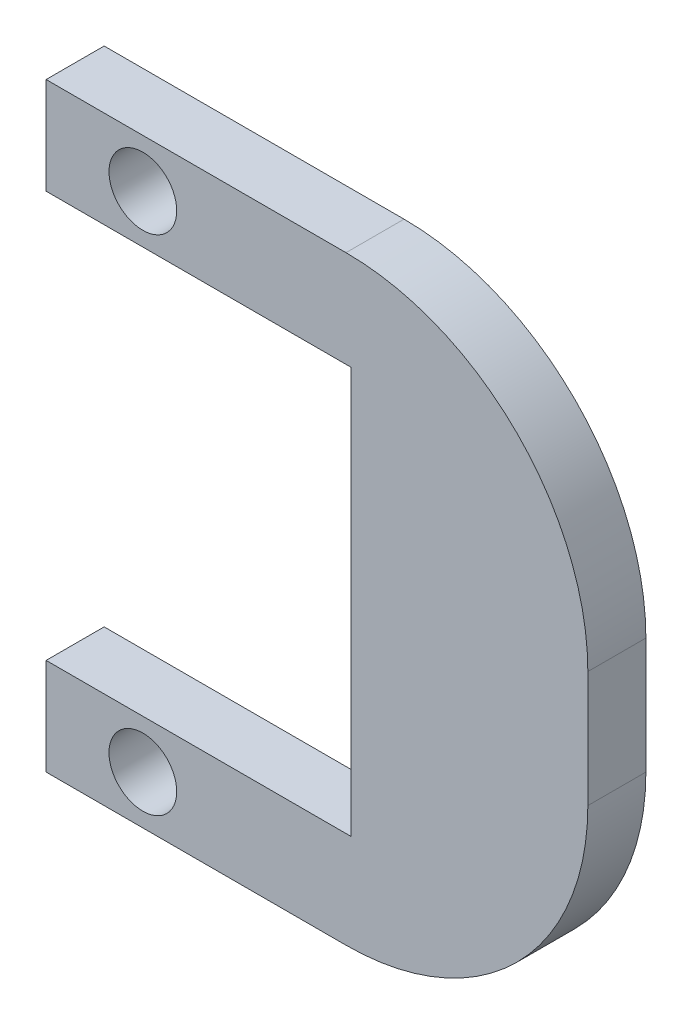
ISO-10303-21;
HEADER;
FILE_DESCRIPTION(('STEP AP214'),'2;1');
FILE_NAME('part.step','',(''),(''),'','','');
FILE_SCHEMA(('AUTOMOTIVE_DESIGN { 1 0 10303 214 1 1 1 1 }'));
ENDSEC;
DATA;
#1=APPLICATION_CONTEXT('core data for automotive mechanical design processes');
#2=APPLICATION_PROTOCOL_DEFINITION('international standard','automotive_design',2000,#1);
#3=PRODUCT_CONTEXT('',#1,'mechanical');
#4=PRODUCT('Part','Part','',(#3));
#5=PRODUCT_RELATED_PRODUCT_CATEGORY('part','',(#4));
#6=PRODUCT_DEFINITION_FORMATION('','',#4);
#7=PRODUCT_DEFINITION_CONTEXT('part definition',#1,'design');
#8=PRODUCT_DEFINITION('design','',#6,#7);
#9=PRODUCT_DEFINITION_SHAPE('','',#8);
#10=(LENGTH_UNIT() NAMED_UNIT(*) SI_UNIT(.MILLI.,.METRE.));
#11=(NAMED_UNIT(*) PLANE_ANGLE_UNIT() SI_UNIT($,.RADIAN.));
#12=(NAMED_UNIT(*) SI_UNIT($,.STERADIAN.) SOLID_ANGLE_UNIT());
#13=UNCERTAINTY_MEASURE_WITH_UNIT(LENGTH_MEASURE(1.E-05),#10,'distance_accuracy_value','');
#14=(GEOMETRIC_REPRESENTATION_CONTEXT(3) GLOBAL_UNCERTAINTY_ASSIGNED_CONTEXT((#13)) GLOBAL_UNIT_ASSIGNED_CONTEXT((#10,
#11,#12)) REPRESENTATION_CONTEXT('',''));
#15=CARTESIAN_POINT('',(0.,0.,0.));
#16=DIRECTION('',(0.,0.,1.));
#17=DIRECTION('',(1.,0.,0.));
#18=AXIS2_PLACEMENT_3D('',#15,#16,#17);
#19=CARTESIAN_POINT('',(3.,-5.99999999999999,6.));
#20=DIRECTION('',(0.,0.,1.));
#21=DIRECTION('',(1.,0.,0.));
#22=AXIS2_PLACEMENT_3D('',#19,#20,#21);
#23=PLANE('',#22);
#24=CARTESIAN_POINT('',(-18.,26.,6.));
#25=DIRECTION('',(0.,0.,1.));
#26=DIRECTION('',(1.,0.,0.));
#27=AXIS2_PLACEMENT_3D('',#24,#25,#26);
#28=CIRCLE('',#27,3.5);
#29=CARTESIAN_POINT('',(-14.5,26.,6.));
#30=VERTEX_POINT('',#29);
#31=EDGE_CURVE('E145',#30,#30,#28,.T.);
#32=ORIENTED_EDGE('',*,*,#31,.F.);
#33=EDGE_LOOP('',(#32));
#34=FACE_BOUND('',#33,.T.);
#35=DIRECTION('',(0.,-1.,0.));
#36=VECTOR('',#35,1.);
#37=CARTESIAN_POINT('',(-28.,31.,6.));
#38=LINE('',#37,#36);
#39=CARTESIAN_POINT('',(-28.,31.,6.));
#40=VERTEX_POINT('',#39);
#41=CARTESIAN_POINT('',(-28.,21.,6.));
#42=VERTEX_POINT('',#41);
#43=EDGE_CURVE('E160',#40,#42,#38,.T.);
#44=ORIENTED_EDGE('',*,*,#43,.T.);
#45=DIRECTION('',(1.,0.,0.));
#46=VECTOR('',#45,1.);
#47=CARTESIAN_POINT('',(-28.,21.,6.));
#48=LINE('',#47,#46);
#49=CARTESIAN_POINT('',(3.5,21.,6.));
#50=VERTEX_POINT('',#49);
#51=EDGE_CURVE('E98',#42,#50,#48,.T.);
#52=ORIENTED_EDGE('',*,*,#51,.T.);
#53=DIRECTION('',(0.,-1.,0.));
#54=VECTOR('',#53,1.);
#55=CARTESIAN_POINT('',(3.5,21.,6.));
#56=LINE('',#55,#54);
#57=CARTESIAN_POINT('',(3.49999999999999,-21.,6.));
#58=VERTEX_POINT('',#57);
#59=EDGE_CURVE('E181',#50,#58,#56,.T.);
#60=ORIENTED_EDGE('',*,*,#59,.T.);
#61=DIRECTION('',(-1.,0.,0.));
#62=VECTOR('',#61,1.);
#63=CARTESIAN_POINT('',(-28.,-21.,6.));
#64=LINE('',#63,#62);
#65=CARTESIAN_POINT('',(-28.,-21.,6.));
#66=VERTEX_POINT('',#65);
#67=EDGE_CURVE('E200',#58,#66,#64,.T.);
#68=ORIENTED_EDGE('',*,*,#67,.T.);
#69=DIRECTION('',(0.,-1.,0.));
#70=VECTOR('',#69,1.);
#71=CARTESIAN_POINT('',(-28.,-21.,6.));
#72=LINE('',#71,#70);
#73=CARTESIAN_POINT('',(-28.,-31.,6.));
#74=VERTEX_POINT('',#73);
#75=EDGE_CURVE('E197',#66,#74,#72,.T.);
#76=ORIENTED_EDGE('',*,*,#75,.T.);
#77=DIRECTION('',(1.,0.,0.));
#78=VECTOR('',#77,1.);
#79=CARTESIAN_POINT('',(-28.,-31.,6.));
#80=LINE('',#79,#78);
#81=CARTESIAN_POINT('',(2.99999999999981,-31.,6.));
#82=VERTEX_POINT('',#81);
#83=EDGE_CURVE('E199',#74,#82,#80,.T.);
#84=ORIENTED_EDGE('',*,*,#83,.T.);
#85=CARTESIAN_POINT('',(3.,-5.99999999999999,6.));
#86=DIRECTION('',(0.,0.,1.));
#87=DIRECTION('',(1.,0.,0.));
#88=AXIS2_PLACEMENT_3D('',#85,#86,#87);
#89=CIRCLE('',#88,25.);
#90=CARTESIAN_POINT('',(28.,-5.99999999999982,6.));
#91=VERTEX_POINT('',#90);
#92=EDGE_CURVE('E123',#82,#91,#89,.T.);
#93=ORIENTED_EDGE('',*,*,#92,.T.);
#94=DIRECTION('',(0.,1.,0.));
#95=VECTOR('',#94,1.);
#96=CARTESIAN_POINT('',(28.,5.99999999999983,6.));
#97=LINE('',#96,#95);
#98=CARTESIAN_POINT('',(28.,5.99999999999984,6.));
#99=VERTEX_POINT('',#98);
#100=EDGE_CURVE('E117',#91,#99,#97,.T.);
#101=ORIENTED_EDGE('',*,*,#100,.T.);
#102=CARTESIAN_POINT('',(3.,6.,6.));
#103=DIRECTION('',(0.,0.,1.));
#104=DIRECTION('',(-1.,0.,0.));
#105=AXIS2_PLACEMENT_3D('',#102,#103,#104);
#106=CIRCLE('',#105,25.);
#107=CARTESIAN_POINT('',(2.99999999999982,31.,6.));
#108=VERTEX_POINT('',#107);
#109=EDGE_CURVE('E121',#99,#108,#106,.T.);
#110=ORIENTED_EDGE('',*,*,#109,.T.);
#111=DIRECTION('',(-1.,0.,0.));
#112=VECTOR('',#111,1.);
#113=CARTESIAN_POINT('',(-28.,31.,6.));
#114=LINE('',#113,#112);
#115=EDGE_CURVE('E49',#108,#40,#114,.T.);
#116=ORIENTED_EDGE('',*,*,#115,.T.);
#117=EDGE_LOOP('',(#44,#52,#60,#68,#76,#84,#93,#101,#110,#116));
#118=FACE_BOUND('',#117,.T.);
#119=CARTESIAN_POINT('',(-18.,-26.,6.));
#120=DIRECTION('',(0.,0.,1.));
#121=DIRECTION('',(-1.,0.,0.));
#122=AXIS2_PLACEMENT_3D('',#119,#120,#121);
#123=CIRCLE('',#122,3.5);
#124=CARTESIAN_POINT('',(-21.5,-26.,6.));
#125=VERTEX_POINT('',#124);
#126=EDGE_CURVE('E211',#125,#125,#123,.T.);
#127=ORIENTED_EDGE('',*,*,#126,.F.);
#128=EDGE_LOOP('',(#127));
#129=FACE_BOUND('',#128,.T.);
#130=ADVANCED_FACE('F32',(#34,#118,#129),#23,.T.);
#131=CARTESIAN_POINT('',(3.,-5.99999999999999,0.));
#132=DIRECTION('',(0.,0.,1.));
#133=DIRECTION('',(1.,0.,0.));
#134=AXIS2_PLACEMENT_3D('',#131,#132,#133);
#135=PLANE('',#134);
#136=DIRECTION('',(0.,-1.,0.));
#137=VECTOR('',#136,1.);
#138=CARTESIAN_POINT('',(-28.,31.,0.));
#139=LINE('',#138,#137);
#140=CARTESIAN_POINT('',(-28.,31.,0.));
#141=VERTEX_POINT('',#140);
#142=CARTESIAN_POINT('',(-28.,21.,0.));
#143=VERTEX_POINT('',#142);
#144=EDGE_CURVE('E141',#141,#143,#139,.T.);
#145=ORIENTED_EDGE('',*,*,#144,.F.);
#146=DIRECTION('',(-1.,0.,0.));
#147=VECTOR('',#146,1.);
#148=CARTESIAN_POINT('',(-28.,31.,0.));
#149=LINE('',#148,#147);
#150=CARTESIAN_POINT('',(2.99999999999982,31.,0.));
#151=VERTEX_POINT('',#150);
#152=EDGE_CURVE('E90',#151,#141,#149,.T.);
#153=ORIENTED_EDGE('',*,*,#152,.F.);
#154=CARTESIAN_POINT('',(3.,6.,0.));
#155=DIRECTION('',(0.,0.,1.));
#156=DIRECTION('',(-1.,0.,0.));
#157=AXIS2_PLACEMENT_3D('',#154,#155,#156);
#158=CIRCLE('',#157,25.);
#159=CARTESIAN_POINT('',(28.,5.99999999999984,0.));
#160=VERTEX_POINT('',#159);
#161=EDGE_CURVE('E84',#160,#151,#158,.T.);
#162=ORIENTED_EDGE('',*,*,#161,.F.);
#163=DIRECTION('',(0.,1.,0.));
#164=VECTOR('',#163,1.);
#165=CARTESIAN_POINT('',(28.,5.99999999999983,0.));
#166=LINE('',#165,#164);
#167=CARTESIAN_POINT('',(28.,-5.99999999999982,0.));
#168=VERTEX_POINT('',#167);
#169=EDGE_CURVE('E131',#168,#160,#166,.T.);
#170=ORIENTED_EDGE('',*,*,#169,.F.);
#171=CARTESIAN_POINT('',(3.,-5.99999999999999,0.));
#172=DIRECTION('',(0.,0.,1.));
#173=DIRECTION('',(1.,0.,0.));
#174=AXIS2_PLACEMENT_3D('',#171,#172,#173);
#175=CIRCLE('',#174,25.);
#176=CARTESIAN_POINT('',(2.99999999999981,-31.,0.));
#177=VERTEX_POINT('',#176);
#178=EDGE_CURVE('E155',#177,#168,#175,.T.);
#179=ORIENTED_EDGE('',*,*,#178,.F.);
#180=DIRECTION('',(1.,0.,0.));
#181=VECTOR('',#180,1.);
#182=CARTESIAN_POINT('',(-28.,-31.,0.));
#183=LINE('',#182,#181);
#184=CARTESIAN_POINT('',(-28.,-31.,0.));
#185=VERTEX_POINT('',#184);
#186=EDGE_CURVE('E153',#185,#177,#183,.T.);
#187=ORIENTED_EDGE('',*,*,#186,.F.);
#188=DIRECTION('',(0.,-1.,0.));
#189=VECTOR('',#188,1.);
#190=CARTESIAN_POINT('',(-28.,-21.,0.));
#191=LINE('',#190,#189);
#192=CARTESIAN_POINT('',(-28.,-21.,0.));
#193=VERTEX_POINT('',#192);
#194=EDGE_CURVE('E151',#193,#185,#191,.T.);
#195=ORIENTED_EDGE('',*,*,#194,.F.);
#196=DIRECTION('',(-1.,0.,0.));
#197=VECTOR('',#196,1.);
#198=CARTESIAN_POINT('',(-28.,-21.,0.));
#199=LINE('',#198,#197);
#200=CARTESIAN_POINT('',(3.49999999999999,-21.,0.));
#201=VERTEX_POINT('',#200);
#202=EDGE_CURVE('E149',#201,#193,#199,.T.);
#203=ORIENTED_EDGE('',*,*,#202,.F.);
#204=DIRECTION('',(0.,-1.,0.));
#205=VECTOR('',#204,1.);
#206=CARTESIAN_POINT('',(3.5,21.,0.));
#207=LINE('',#206,#205);
#208=CARTESIAN_POINT('',(3.5,21.,0.));
#209=VERTEX_POINT('',#208);
#210=EDGE_CURVE('E147',#209,#201,#207,.T.);
#211=ORIENTED_EDGE('',*,*,#210,.F.);
#212=DIRECTION('',(1.,0.,0.));
#213=VECTOR('',#212,1.);
#214=CARTESIAN_POINT('',(-28.,21.,0.));
#215=LINE('',#214,#213);
#216=EDGE_CURVE('E144',#143,#209,#215,.T.);
#217=ORIENTED_EDGE('',*,*,#216,.F.);
#218=EDGE_LOOP('',(#145,#153,#162,#170,#179,#187,#195,#203,#211,#217));
#219=FACE_BOUND('',#218,.T.);
#220=CARTESIAN_POINT('',(-18.,26.,0.));
#221=DIRECTION('',(0.,0.,1.));
#222=DIRECTION('',(1.,0.,0.));
#223=AXIS2_PLACEMENT_3D('',#220,#221,#222);
#224=CIRCLE('',#223,3.5);
#225=CARTESIAN_POINT('',(-14.5,26.,0.));
#226=VERTEX_POINT('',#225);
#227=EDGE_CURVE('E208',#226,#226,#224,.T.);
#228=ORIENTED_EDGE('',*,*,#227,.T.);
#229=EDGE_LOOP('',(#228));
#230=FACE_BOUND('',#229,.T.);
#231=CARTESIAN_POINT('',(-18.,-26.,0.));
#232=DIRECTION('',(0.,0.,1.));
#233=DIRECTION('',(-1.,0.,0.));
#234=AXIS2_PLACEMENT_3D('',#231,#232,#233);
#235=CIRCLE('',#234,3.5);
#236=CARTESIAN_POINT('',(-21.5,-26.,0.));
#237=VERTEX_POINT('',#236);
#238=EDGE_CURVE('E214',#237,#237,#235,.T.);
#239=ORIENTED_EDGE('',*,*,#238,.T.);
#240=EDGE_LOOP('',(#239));
#241=FACE_BOUND('',#240,.T.);
#242=ADVANCED_FACE('F185',(#219,#230,#241),#135,.F.);
#243=CARTESIAN_POINT('',(-28.,31.,6.));
#244=DIRECTION('',(1.,0.,0.));
#245=DIRECTION('',(0.,1.,0.));
#246=AXIS2_PLACEMENT_3D('',#243,#244,#245);
#247=PLANE('',#246);
#248=ORIENTED_EDGE('',*,*,#144,.T.);
#249=DIRECTION('',(0.,0.,-1.));
#250=VECTOR('',#249,1.);
#251=CARTESIAN_POINT('',(-28.,21.,6.));
#252=LINE('',#251,#250);
#253=EDGE_CURVE('E11',#42,#143,#252,.T.);
#254=ORIENTED_EDGE('',*,*,#253,.F.);
#255=ORIENTED_EDGE('',*,*,#43,.F.);
#256=DIRECTION('',(0.,0.,-1.));
#257=VECTOR('',#256,1.);
#258=CARTESIAN_POINT('',(-28.,31.,6.));
#259=LINE('',#258,#257);
#260=EDGE_CURVE('E137',#40,#141,#259,.T.);
#261=ORIENTED_EDGE('',*,*,#260,.T.);
#262=EDGE_LOOP('',(#248,#254,#255,#261));
#263=FACE_BOUND('',#262,.T.);
#264=ADVANCED_FACE('F34',(#263),#247,.F.);
#265=CARTESIAN_POINT('',(-28.,21.,6.));
#266=DIRECTION('',(0.,1.,0.));
#267=DIRECTION('',(-1.,0.,0.));
#268=AXIS2_PLACEMENT_3D('',#265,#266,#267);
#269=PLANE('',#268);
#270=ORIENTED_EDGE('',*,*,#216,.T.);
#271=DIRECTION('',(0.,0.,-1.));
#272=VECTOR('',#271,1.);
#273=CARTESIAN_POINT('',(3.5,21.,6.));
#274=LINE('',#273,#272);
#275=EDGE_CURVE('E41',#50,#209,#274,.T.);
#276=ORIENTED_EDGE('',*,*,#275,.F.);
#277=ORIENTED_EDGE('',*,*,#51,.F.);
#278=ORIENTED_EDGE('',*,*,#253,.T.);
#279=EDGE_LOOP('',(#270,#276,#277,#278));
#280=FACE_BOUND('',#279,.T.);
#281=ADVANCED_FACE('F254',(#280),#269,.F.);
#282=CARTESIAN_POINT('',(3.5,21.,6.));
#283=DIRECTION('',(1.,0.,0.));
#284=DIRECTION('',(0.,1.,0.));
#285=AXIS2_PLACEMENT_3D('',#282,#283,#284);
#286=PLANE('',#285);
#287=ORIENTED_EDGE('',*,*,#210,.T.);
#288=DIRECTION('',(0.,0.,-1.));
#289=VECTOR('',#288,1.);
#290=CARTESIAN_POINT('',(3.49999999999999,-21.,6.));
#291=LINE('',#290,#289);
#292=EDGE_CURVE('E173',#58,#201,#291,.T.);
#293=ORIENTED_EDGE('',*,*,#292,.F.);
#294=ORIENTED_EDGE('',*,*,#59,.F.);
#295=ORIENTED_EDGE('',*,*,#275,.T.);
#296=EDGE_LOOP('',(#287,#293,#294,#295));
#297=FACE_BOUND('',#296,.T.);
#298=ADVANCED_FACE('F179',(#297),#286,.F.);
#299=CARTESIAN_POINT('',(-28.,-21.,6.));
#300=DIRECTION('',(0.,-1.,0.));
#301=DIRECTION('',(1.,0.,0.));
#302=AXIS2_PLACEMENT_3D('',#299,#300,#301);
#303=PLANE('',#302);
#304=ORIENTED_EDGE('',*,*,#202,.T.);
#305=DIRECTION('',(0.,0.,-1.));
#306=VECTOR('',#305,1.);
#307=CARTESIAN_POINT('',(-28.,-21.,6.));
#308=LINE('',#307,#306);
#309=EDGE_CURVE('E170',#66,#193,#308,.T.);
#310=ORIENTED_EDGE('',*,*,#309,.F.);
#311=ORIENTED_EDGE('',*,*,#67,.F.);
#312=ORIENTED_EDGE('',*,*,#292,.T.);
#313=EDGE_LOOP('',(#304,#310,#311,#312));
#314=FACE_BOUND('',#313,.T.);
#315=ADVANCED_FACE('F191',(#314),#303,.F.);
#316=CARTESIAN_POINT('',(-28.,-21.,6.));
#317=DIRECTION('',(1.,0.,0.));
#318=DIRECTION('',(0.,1.,0.));
#319=AXIS2_PLACEMENT_3D('',#316,#317,#318);
#320=PLANE('',#319);
#321=ORIENTED_EDGE('',*,*,#194,.T.);
#322=DIRECTION('',(0.,0.,-1.));
#323=VECTOR('',#322,1.);
#324=CARTESIAN_POINT('',(-28.,-31.,6.));
#325=LINE('',#324,#323);
#326=EDGE_CURVE('E167',#74,#185,#325,.T.);
#327=ORIENTED_EDGE('',*,*,#326,.F.);
#328=ORIENTED_EDGE('',*,*,#75,.F.);
#329=ORIENTED_EDGE('',*,*,#309,.T.);
#330=EDGE_LOOP('',(#321,#327,#328,#329));
#331=FACE_BOUND('',#330,.T.);
#332=ADVANCED_FACE('F195',(#331),#320,.F.);
#333=CARTESIAN_POINT('',(-28.,-31.,6.));
#334=DIRECTION('',(0.,1.,0.));
#335=DIRECTION('',(0.,0.,1.));
#336=AXIS2_PLACEMENT_3D('',#333,#334,#335);
#337=PLANE('',#336);
#338=ORIENTED_EDGE('',*,*,#186,.T.);
#339=DIRECTION('',(0.,0.,-1.));
#340=VECTOR('',#339,1.);
#341=CARTESIAN_POINT('',(2.99999999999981,-31.,6.));
#342=LINE('',#341,#340);
#343=EDGE_CURVE('E164',#82,#177,#342,.T.);
#344=ORIENTED_EDGE('',*,*,#343,.F.);
#345=ORIENTED_EDGE('',*,*,#83,.F.);
#346=ORIENTED_EDGE('',*,*,#326,.T.);
#347=EDGE_LOOP('',(#338,#344,#345,#346));
#348=FACE_BOUND('',#347,.T.);
#349=ADVANCED_FACE('F244',(#348),#337,.F.);
#350=CARTESIAN_POINT('',(3.,-5.99999999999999,6.));
#351=DIRECTION('',(0.,0.,-1.));
#352=DIRECTION('',(-1.,0.,0.));
#353=AXIS2_PLACEMENT_3D('',#350,#351,#352);
#354=CYLINDRICAL_SURFACE('',#353,25.);
#355=ORIENTED_EDGE('',*,*,#178,.T.);
#356=DIRECTION('',(0.,0.,-1.));
#357=VECTOR('',#356,1.);
#358=CARTESIAN_POINT('',(28.,-5.99999999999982,6.));
#359=LINE('',#358,#357);
#360=EDGE_CURVE('E132',#91,#168,#359,.T.);
#361=ORIENTED_EDGE('',*,*,#360,.F.);
#362=ORIENTED_EDGE('',*,*,#92,.F.);
#363=ORIENTED_EDGE('',*,*,#343,.T.);
#364=EDGE_LOOP('',(#355,#361,#362,#363));
#365=FACE_BOUND('',#364,.T.);
#366=ADVANCED_FACE('F241',(#365),#354,.T.);
#367=CARTESIAN_POINT('',(28.,5.99999999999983,6.));
#368=DIRECTION('',(-1.,0.,0.));
#369=DIRECTION('',(0.,0.,1.));
#370=AXIS2_PLACEMENT_3D('',#367,#368,#369);
#371=PLANE('',#370);
#372=ORIENTED_EDGE('',*,*,#169,.T.);
#373=DIRECTION('',(0.,0.,-1.));
#374=VECTOR('',#373,1.);
#375=CARTESIAN_POINT('',(28.,5.99999999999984,6.));
#376=LINE('',#375,#374);
#377=EDGE_CURVE('E128',#99,#160,#376,.T.);
#378=ORIENTED_EDGE('',*,*,#377,.F.);
#379=ORIENTED_EDGE('',*,*,#100,.F.);
#380=ORIENTED_EDGE('',*,*,#360,.T.);
#381=EDGE_LOOP('',(#372,#378,#379,#380));
#382=FACE_BOUND('',#381,.T.);
#383=ADVANCED_FACE('F129',(#382),#371,.F.);
#384=CARTESIAN_POINT('',(3.,6.,6.));
#385=DIRECTION('',(0.,0.,-1.));
#386=DIRECTION('',(-1.,0.,0.));
#387=AXIS2_PLACEMENT_3D('',#384,#385,#386);
#388=CYLINDRICAL_SURFACE('',#387,25.);
#389=ORIENTED_EDGE('',*,*,#161,.T.);
#390=DIRECTION('',(0.,0.,-1.));
#391=VECTOR('',#390,1.);
#392=CARTESIAN_POINT('',(2.99999999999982,31.,6.));
#393=LINE('',#392,#391);
#394=EDGE_CURVE('E133',#108,#151,#393,.T.);
#395=ORIENTED_EDGE('',*,*,#394,.F.);
#396=ORIENTED_EDGE('',*,*,#109,.F.);
#397=ORIENTED_EDGE('',*,*,#377,.T.);
#398=EDGE_LOOP('',(#389,#395,#396,#397));
#399=FACE_BOUND('',#398,.T.);
#400=ADVANCED_FACE('F135',(#399),#388,.T.);
#401=CARTESIAN_POINT('',(-28.,31.,6.));
#402=DIRECTION('',(0.,-1.,0.));
#403=DIRECTION('',(0.,0.,-1.));
#404=AXIS2_PLACEMENT_3D('',#401,#402,#403);
#405=PLANE('',#404);
#406=ORIENTED_EDGE('',*,*,#152,.T.);
#407=ORIENTED_EDGE('',*,*,#260,.F.);
#408=ORIENTED_EDGE('',*,*,#115,.F.);
#409=ORIENTED_EDGE('',*,*,#394,.T.);
#410=EDGE_LOOP('',(#406,#407,#408,#409));
#411=FACE_BOUND('',#410,.T.);
#412=ADVANCED_FACE('F234',(#411),#405,.F.);
#413=CARTESIAN_POINT('',(-18.,26.,6.));
#414=DIRECTION('',(0.,0.,-1.));
#415=DIRECTION('',(-1.,0.,0.));
#416=AXIS2_PLACEMENT_3D('',#413,#414,#415);
#417=CYLINDRICAL_SURFACE('',#416,3.5);
#418=ORIENTED_EDGE('',*,*,#31,.T.);
#419=EDGE_LOOP('',(#418));
#420=FACE_BOUND('',#419,.T.);
#421=ORIENTED_EDGE('',*,*,#227,.F.);
#422=EDGE_LOOP('',(#421));
#423=FACE_BOUND('',#422,.T.);
#424=ADVANCED_FACE('F231',(#420,#423),#417,.F.);
#425=CARTESIAN_POINT('',(-18.,-26.,6.));
#426=DIRECTION('',(0.,0.,-1.));
#427=DIRECTION('',(-1.,0.,0.));
#428=AXIS2_PLACEMENT_3D('',#425,#426,#427);
#429=CYLINDRICAL_SURFACE('',#428,3.5);
#430=ORIENTED_EDGE('',*,*,#126,.T.);
#431=EDGE_LOOP('',(#430));
#432=FACE_BOUND('',#431,.T.);
#433=ORIENTED_EDGE('',*,*,#238,.F.);
#434=EDGE_LOOP('',(#433));
#435=FACE_BOUND('',#434,.T.);
#436=ADVANCED_FACE('F220',(#432,#435),#429,.F.);
#437=CLOSED_SHELL('',(#130,#242,#264,#281,#298,#315,#332,#349,#366,#383,#400,#412,#424,#436));
#438=MANIFOLD_SOLID_BREP('B2',#437);
#439=ADVANCED_BREP_SHAPE_REPRESENTATION('',(#18,#438),#14);
#440=SHAPE_DEFINITION_REPRESENTATION(#9,#439);
ENDSEC;
END-ISO-10303-21;
